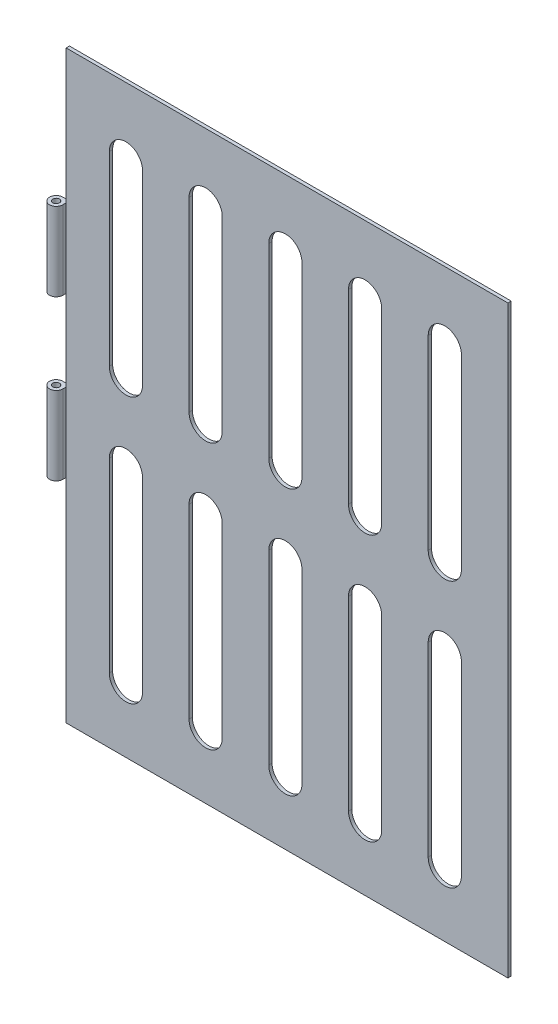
from build123d import *

# Parameters (mm, degrees)
SKETCH1_W            = 844.55
SKETCH1_H            = 1117.6
EXTRUDE1_DEPTH       = 6.35
SKETCH2_R            = 6.35
EXTRUDE3_DEPTH       = 149.86
LPATTERN1_COUNT      = 2
LPATTERN1_PITCH      = 304.8
LPATTERN1_COUNT_DIR2 = 2
LPATTERN1_PITCH_DIR2 = 50
CUT_EXTRUDE1_DEPTH   = 6.35


with BuildPart() as part:
    # Sketch1 → Extrude1 (new body)
    with BuildSketch(Plane.XY):
        with Locations((422.275, 558.8)):
            Rectangle(SKETCH1_W, SKETCH1_H)
    extrude(amount=-EXTRUDE1_DEPTH)

    # Sketch2 → Extrude3 (add)
    with BuildSketch(Plane(origin=(0, 406.4, 0), x_dir=(-1, 0, 0), z_dir=(0, 1, 0))):
        with BuildLine():
            Line((0, -6.35), (12.7, -6.35))
            ThreePointArc((12.7, -6.35), (21.680256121, 15.330256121), (0, 6.35))
            Line((0, 6.35), (0, -6.35))
        make_face()
        with Locations(Location((12.7, 6.35, 0), (0, 0, 90))):
            Circle(SKETCH2_R, mode=Mode.SUBTRACT)
    extrude3 = extrude(amount=EXTRUDE3_DEPTH)

    # LPattern1: Extrude3 2 × 2, 2 skipped
    with Locations(*[(j * LPATTERN1_PITCH_DIR2, i * LPATTERN1_PITCH, 0) for i in range(LPATTERN1_COUNT) for j in range(LPATTERN1_COUNT_DIR2) if (i, j) not in ((0, 0), (0, 1), (1, 1))]):
        add(extrude3)

    # Sketch3 → Cut-Extrude1 (cut)
    with BuildSketch(Plane(origin=(0, 0, -6.35), x_dir=(-1, 0, 0), z_dir=(0, 0, -1))):
        with BuildLine():
            Line((-755.65, 987.552), (-755.65, 631.952))
            ThreePointArc((-755.65, 631.952), (-723.9, 600.202), (-692.15, 631.952))
            Line((-692.15, 631.952), (-692.15, 987.552))
            ThreePointArc((-692.15, 987.552), (-723.9, 1019.302), (-755.65, 987.552))
        make_face()
        with BuildLine():
            Line((-603.25, 987.552), (-603.25, 631.952))
            ThreePointArc((-603.25, 631.952), (-571.5, 600.202), (-539.75, 631.952))
            Line((-539.75, 631.952), (-539.75, 987.552))
            ThreePointArc((-539.75, 987.552), (-571.5, 1019.302), (-603.25, 987.552))
        make_face()
        with BuildLine():
            Line((-450.85, 987.552), (-450.85, 631.952))
            ThreePointArc((-450.85, 631.952), (-419.1, 600.202), (-387.35, 631.952))
            Line((-387.35, 631.952), (-387.35, 987.552))
            ThreePointArc((-387.35, 987.552), (-419.1, 1019.302), (-450.85, 987.552))
        make_face()
        with BuildLine():
            Line((-298.45, 987.552), (-298.45, 631.952))
            ThreePointArc((-298.45, 631.952), (-266.7, 600.202), (-234.95, 631.952))
            Line((-234.95, 631.952), (-234.95, 987.552))
            ThreePointArc((-234.95, 987.552), (-266.7, 1019.302), (-298.45, 987.552))
        make_face()
        with BuildLine():
            Line((-146.05, 987.552), (-146.05, 631.952))
            ThreePointArc((-146.05, 631.952), (-114.3, 600.202), (-82.55, 631.952))
            Line((-82.55, 631.952), (-82.55, 987.552))
            ThreePointArc((-82.55, 987.552), (-114.3, 1019.302), (-146.05, 987.552))
        make_face()
        with BuildLine():
            Line((-755.65, 479.552), (-755.65, 123.952))
            ThreePointArc((-755.65, 123.952), (-723.9, 92.202), (-692.15, 123.952))
            Line((-692.15, 123.952), (-692.15, 479.552))
            ThreePointArc((-692.15, 479.552), (-723.9, 511.302), (-755.65, 479.552))
        make_face()
        with BuildLine():
            Line((-603.25, 479.552), (-603.25, 123.952))
            ThreePointArc((-603.25, 123.952), (-571.5, 92.202), (-539.75, 123.952))
            Line((-539.75, 123.952), (-539.75, 479.552))
            ThreePointArc((-539.75, 479.552), (-571.5, 511.302), (-603.25, 479.552))
        make_face()
        with BuildLine():
            Line((-450.85, 479.552), (-450.85, 123.952))
            ThreePointArc((-450.85, 123.952), (-419.1, 92.202), (-387.35, 123.952))
            Line((-387.35, 123.952), (-387.35, 479.552))
            ThreePointArc((-387.35, 479.552), (-419.1, 511.302), (-450.85, 479.552))
        make_face()
        with BuildLine():
            Line((-298.45, 479.552), (-298.45, 123.952))
            ThreePointArc((-298.45, 123.952), (-266.7, 92.202), (-234.95, 123.952))
            Line((-234.95, 123.952), (-234.95, 479.552))
            ThreePointArc((-234.95, 479.552), (-266.7, 511.302), (-298.45, 479.552))
        make_face()
        with BuildLine():
            Line((-146.05, 479.552), (-146.05, 123.952))
            ThreePointArc((-146.05, 123.952), (-114.3, 92.202), (-82.55, 123.952))
            Line((-82.55, 123.952), (-82.55, 479.552))
            ThreePointArc((-82.55, 479.552), (-114.3, 511.302), (-146.05, 479.552))
        make_face()
    extrude(amount=-CUT_EXTRUDE1_DEPTH, mode=Mode.SUBTRACT)


solid = part.part
